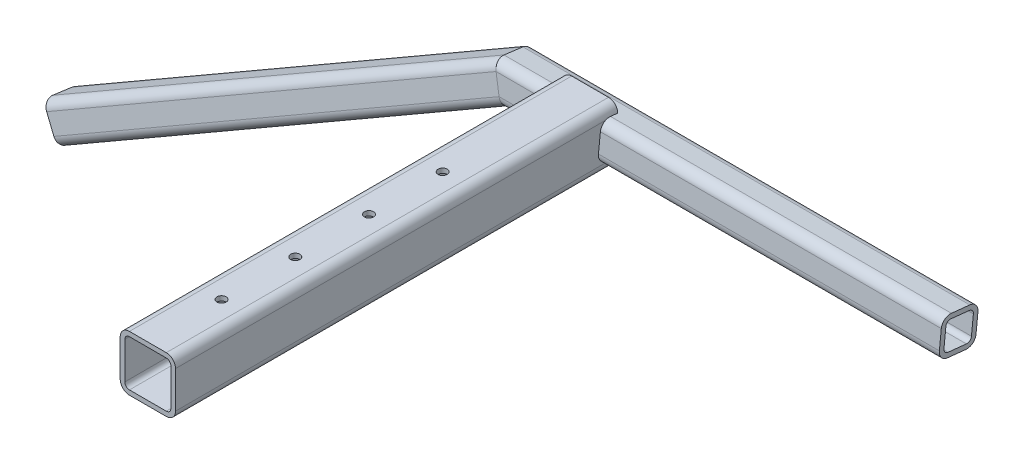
from build123d import *

# Parameters (mm, degrees)
SQUARE_TUBE_2_X_2_X_0_25_1_DEPTH        = 620.225009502
SQUARE_TUBE_2_X_2_X_0_25_1_2_DEPTH      = 711.2
SQUARE_TUBE_2_X_2_X_0_25_1_2_DEPTH_BACK = 10.625009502
SQUARE_TUBE_3_X_3_X_0_25_1_DEPTH        = 609.6
SKETCH14_R                              = 6.35
CUT_EXTRUDE1_DEPTH                      = 1443.242388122


with BuildPart() as part:
    # Sketch1 on segment 1 (on carried to segment 1) → Square tube 2 X 2 X 0.25_1 (new body)
    with BuildSketch(Plane(origin=(0, 0, 0), x_dir=(0, 0.104528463, 0.994521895), z_dir=(-1, 0, 0))):
        with BuildLine():
            Line((-12.7, -25.4), (12.7, -25.4))
            ThreePointArc((12.7, -25.4), (21.680256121, -21.680256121), (25.4, -12.7))
            Line((25.4, -12.7), (25.4, 12.7))
            ThreePointArc((25.4, 12.7), (21.680256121, 21.680256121), (12.7, 25.4))
            Line((12.7, 25.4), (-12.7, 25.4))
            ThreePointArc((-12.7, 25.4), (-21.680256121, 21.680256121), (-25.4, 12.7))
            Line((-25.4, 12.7), (-25.4, -12.7))
            ThreePointArc((-25.4, -12.7), (-21.680256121, -21.680256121), (-12.7, -25.4))
        make_face()
        with BuildLine():
            Line((-12.7, -19.05), (12.7, -19.05))
            ThreePointArc((12.7, -19.05), (17.190128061, -17.190128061), (19.05, -12.7))
            Line((19.05, -12.7), (19.05, 12.7))
            ThreePointArc((19.05, 12.7), (17.190128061, 17.190128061), (12.7, 19.05))
            Line((12.7, 19.05), (-12.7, 19.05))
            ThreePointArc((-12.7, 19.05), (-17.190128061, 17.190128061), (-19.05, 12.7))
            Line((-19.05, 12.7), (-19.05, -12.7))
            ThreePointArc((-19.05, -12.7), (-17.190128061, -17.190128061), (-12.7, -19.05))
        make_face(mode=Mode.SUBTRACT)
    extrude(amount=SQUARE_TUBE_2_X_2_X_0_25_1_DEPTH)

    # Square tube 2 X 2 X 0.25_1 mitre 1
    split(bisect_by=Plane(origin=(-609.6, 0, 0), x_dir=(-0.258819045, 0.965925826, 0), z_dir=(0.965925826, 0.258819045, 0)), keep=Keep.TOP)


with BuildPart() as body_2:
    # Sketch1 → Square tube 2 X 2 X 0.25_1 2 (new, two sides: drawn at the far end of the back side and taken through both)
    with BuildSketch(Plane(origin=(-609.6, 0, 0), x_dir=(-0.05226423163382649, 0.09052430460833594, 0.9945218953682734), z_dir=(-0.8660254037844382, -0.5000000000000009, 0)).offset(-SQUARE_TUBE_2_X_2_X_0_25_1_2_DEPTH_BACK)):
        with BuildLine():
            Line((-12.7, -25.4), (12.7, -25.4))
            ThreePointArc((12.7, -25.4), (21.680256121, -21.680256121), (25.4, -12.7))
            Line((25.4, -12.7), (25.4, 12.7))
            ThreePointArc((25.4, 12.7), (21.680256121, 21.680256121), (12.7, 25.4))
            Line((12.7, 25.4), (-12.7, 25.4))
            ThreePointArc((-12.7, 25.4), (-21.680256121, 21.680256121), (-25.4, 12.7))
            Line((-25.4, 12.7), (-25.4, -12.7))
            ThreePointArc((-25.4, -12.7), (-21.680256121, -21.680256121), (-12.7, -25.4))
        make_face()
        with BuildLine():
            Line((-12.7, -19.05), (12.7, -19.05))
            ThreePointArc((12.7, -19.05), (17.190128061, -17.190128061), (19.05, -12.7))
            Line((19.05, -12.7), (19.05, 12.7))
            ThreePointArc((19.05, 12.7), (17.190128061, 17.190128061), (12.7, 19.05))
            Line((12.7, 19.05), (-12.7, 19.05))
            ThreePointArc((-12.7, 19.05), (-17.190128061, 17.190128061), (-19.05, 12.7))
            Line((-19.05, 12.7), (-19.05, -12.7))
            ThreePointArc((-19.05, -12.7), (-17.190128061, -17.190128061), (-12.7, -19.05))
        make_face(mode=Mode.SUBTRACT)
    extrude(amount=SQUARE_TUBE_2_X_2_X_0_25_1_2_DEPTH + SQUARE_TUBE_2_X_2_X_0_25_1_2_DEPTH_BACK)

    # Square tube 2 X 2 X 0.25_1 2 mitre 1
    split(bisect_by=Plane(origin=(-609.6, 0, 0), x_dir=(0.258819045, -0.965925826, 0), z_dir=(-0.965925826, -0.258819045, 0)), keep=Keep.TOP)


with BuildPart() as body_3:
    # Sketch13 → Square tube 3 X 3 X 0.25_1 (new body)
    with BuildSketch(Plane(origin=(-508, 0, 0), x_dir=(1, 0, 0), z_dir=(0, 0, 1))):
        with BuildLine():
            Line((-25.4, -38.1), (25.4, -38.1))
            ThreePointArc((25.4, -38.1), (34.380256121, -34.380256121), (38.1, -25.4))
            Line((38.1, -25.4), (38.1, 25.4))
            ThreePointArc((38.1, 25.4), (34.380256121, 34.380256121), (25.4, 38.1))
            Line((25.4, 38.1), (-25.4, 38.1))
            ThreePointArc((-25.4, 38.1), (-34.380256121, 34.380256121), (-38.1, 25.4))
            Line((-38.1, 25.4), (-38.1, -25.4))
            ThreePointArc((-38.1, -25.4), (-34.380256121, -34.380256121), (-25.4, -38.1))
        make_face()
        with BuildLine():
            Line((-25.4, -31.75), (25.4, -31.75))
            ThreePointArc((25.4, -31.75), (29.890128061, -29.890128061), (31.75, -25.4))
            Line((31.75, -25.4), (31.75, 25.4))
            ThreePointArc((31.75, 25.4), (29.890128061, 29.890128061), (25.4, 31.75))
            Line((25.4, 31.75), (-25.4, 31.75))
            ThreePointArc((-25.4, 31.75), (-29.890128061, 29.890128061), (-31.75, 25.4))
            Line((-31.75, 25.4), (-31.75, -25.4))
            ThreePointArc((-31.75, -25.4), (-29.890128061, -29.890128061), (-25.4, -31.75))
        make_face(mode=Mode.SUBTRACT)
    extrude(amount=SQUARE_TUBE_3_X_3_X_0_25_1_DEPTH)

    # Sketch14 → Cut-Extrude1 (cut, through all)
    with BuildSketch(Plane(origin=(0, 38.1, 0), x_dir=(1, 0, 0), z_dir=(0, 1, 0))):
        with Locations(Location((-508, -508, 0), (0, 0, 270))):
            Circle(SKETCH14_R)
        with Locations(Location((-508, -406.4, 0), (0, 0, 270))):
            Circle(SKETCH14_R)
        with Locations(Location((-508, -304.8, 0), (0, 0, 270))):
            Circle(SKETCH14_R)
        with Locations(Location((-508, -203.2, 0), (0, 0, 270))):
            Circle(SKETCH14_R)
    extrude(amount=-CUT_EXTRUDE1_DEPTH, mode=Mode.SUBTRACT)


solid = Compound([part.part, body_2.part, body_3.part])
